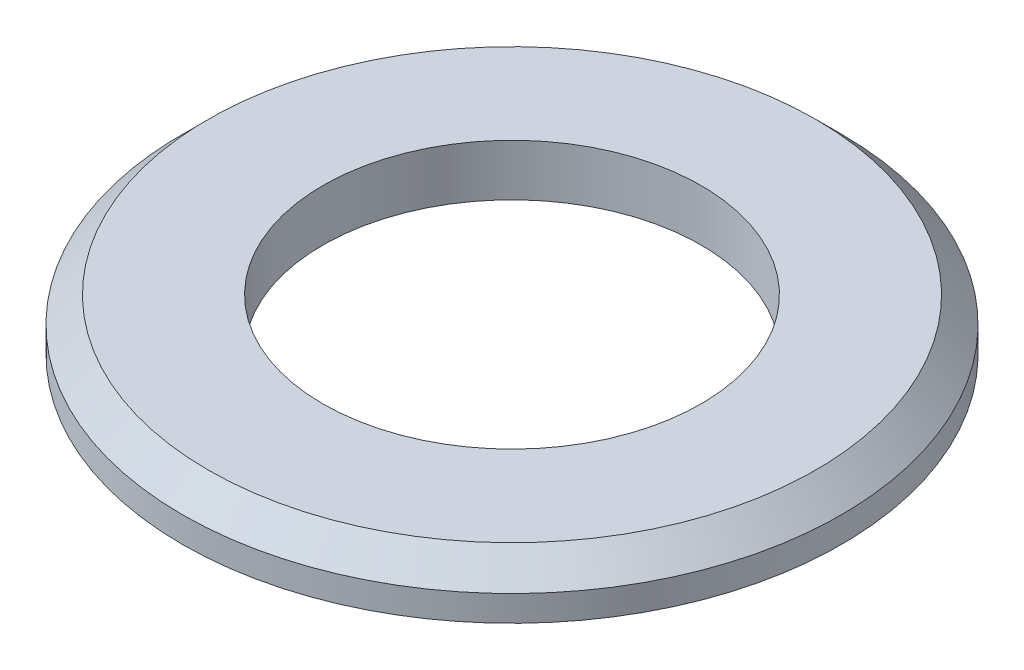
ISO-10303-21;
HEADER;
FILE_DESCRIPTION(('STEP AP214'),'2;1');
FILE_NAME('part.step','',(''),(''),'','','');
FILE_SCHEMA(('AUTOMOTIVE_DESIGN { 1 0 10303 214 1 1 1 1 }'));
ENDSEC;
DATA;
#1=APPLICATION_CONTEXT('core data for automotive mechanical design processes');
#2=APPLICATION_PROTOCOL_DEFINITION('international standard','automotive_design',2000,#1);
#3=PRODUCT_CONTEXT('',#1,'mechanical');
#4=PRODUCT('Part','Part','',(#3));
#5=PRODUCT_RELATED_PRODUCT_CATEGORY('part','',(#4));
#6=PRODUCT_DEFINITION_FORMATION('','',#4);
#7=PRODUCT_DEFINITION_CONTEXT('part definition',#1,'design');
#8=PRODUCT_DEFINITION('design','',#6,#7);
#9=PRODUCT_DEFINITION_SHAPE('','',#8);
#10=(LENGTH_UNIT() NAMED_UNIT(*) SI_UNIT(.MILLI.,.METRE.));
#11=(NAMED_UNIT(*) PLANE_ANGLE_UNIT() SI_UNIT($,.RADIAN.));
#12=(NAMED_UNIT(*) SI_UNIT($,.STERADIAN.) SOLID_ANGLE_UNIT());
#13=UNCERTAINTY_MEASURE_WITH_UNIT(LENGTH_MEASURE(1.E-05),#10,'distance_accuracy_value','');
#14=(GEOMETRIC_REPRESENTATION_CONTEXT(3) GLOBAL_UNCERTAINTY_ASSIGNED_CONTEXT((#13)) GLOBAL_UNIT_ASSIGNED_CONTEXT((#10,
#11,#12)) REPRESENTATION_CONTEXT('',''));
#15=CARTESIAN_POINT('',(0.,0.,0.));
#16=DIRECTION('',(0.,0.,1.));
#17=DIRECTION('',(1.,0.,0.));
#18=AXIS2_PLACEMENT_3D('',#15,#16,#17);
#19=CARTESIAN_POINT('',(0.,9.,0.));
#20=DIRECTION('',(0.,1.,0.));
#21=DIRECTION('',(0.,0.,1.));
#22=AXIS2_PLACEMENT_3D('',#19,#20,#21);
#23=PLANE('',#22);
#24=CARTESIAN_POINT('',(0.,9.,0.));
#25=DIRECTION('',(0.,1.,0.));
#26=DIRECTION('',(0.,0.,1.));
#27=AXIS2_PLACEMENT_3D('',#24,#25,#26);
#28=CIRCLE('',#27,53.);
#29=CARTESIAN_POINT('',(0.,9.,53.));
#30=VERTEX_POINT('',#29);
#31=EDGE_CURVE('E35',#30,#30,#28,.T.);
#32=ORIENTED_EDGE('',*,*,#31,.T.);
#33=EDGE_LOOP('',(#32));
#34=FACE_BOUND('',#33,.T.);
#35=CARTESIAN_POINT('',(0.,9.,0.));
#36=DIRECTION('',(0.,1.,0.));
#37=DIRECTION('',(0.,0.,1.));
#38=AXIS2_PLACEMENT_3D('',#35,#36,#37);
#39=CIRCLE('',#38,33.);
#40=CARTESIAN_POINT('',(0.,9.,33.));
#41=VERTEX_POINT('',#40);
#42=EDGE_CURVE('E43',#41,#41,#39,.T.);
#43=ORIENTED_EDGE('',*,*,#42,.F.);
#44=EDGE_LOOP('',(#43));
#45=FACE_BOUND('',#44,.T.);
#46=ADVANCED_FACE('F28',(#34,#45),#23,.T.);
#47=CARTESIAN_POINT('',(0.,0.,0.));
#48=DIRECTION('',(0.,1.,0.));
#49=DIRECTION('',(0.,0.,1.));
#50=AXIS2_PLACEMENT_3D('',#47,#48,#49);
#51=PLANE('',#50);
#52=CARTESIAN_POINT('',(0.,0.,0.));
#53=DIRECTION('',(0.,1.,0.));
#54=DIRECTION('',(0.,0.,1.));
#55=AXIS2_PLACEMENT_3D('',#52,#53,#54);
#56=CIRCLE('',#55,57.5);
#57=CARTESIAN_POINT('',(0.,0.,57.5));
#58=VERTEX_POINT('',#57);
#59=EDGE_CURVE('E39',#58,#58,#56,.T.);
#60=ORIENTED_EDGE('',*,*,#59,.F.);
#61=EDGE_LOOP('',(#60));
#62=FACE_BOUND('',#61,.T.);
#63=CARTESIAN_POINT('',(0.,0.,0.));
#64=DIRECTION('',(0.,1.,0.));
#65=DIRECTION('',(0.,0.,1.));
#66=AXIS2_PLACEMENT_3D('',#63,#64,#65);
#67=CIRCLE('',#66,33.);
#68=CARTESIAN_POINT('',(0.,0.,33.));
#69=VERTEX_POINT('',#68);
#70=EDGE_CURVE('E48',#69,#69,#67,.T.);
#71=ORIENTED_EDGE('',*,*,#70,.T.);
#72=EDGE_LOOP('',(#71));
#73=FACE_BOUND('',#72,.T.);
#74=ADVANCED_FACE('F52',(#62,#73),#51,.F.);
#75=CARTESIAN_POINT('',(0.,9.,0.));
#76=DIRECTION('',(0.,-1.,0.));
#77=DIRECTION('',(0.,0.,-1.));
#78=AXIS2_PLACEMENT_3D('',#75,#76,#77);
#79=CYLINDRICAL_SURFACE('',#78,57.5);
#80=CARTESIAN_POINT('',(0.,4.50000000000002,0.));
#81=DIRECTION('',(0.,1.,0.));
#82=DIRECTION('',(0.,0.,1.));
#83=AXIS2_PLACEMENT_3D('',#80,#81,#82);
#84=CIRCLE('',#83,57.5);
#85=CARTESIAN_POINT('',(0.,4.50000000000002,57.5));
#86=VERTEX_POINT('',#85);
#87=EDGE_CURVE('E10',#86,#86,#84,.F.);
#88=ORIENTED_EDGE('',*,*,#87,.T.);
#89=EDGE_LOOP('',(#88));
#90=FACE_BOUND('',#89,.T.);
#91=ORIENTED_EDGE('',*,*,#59,.T.);
#92=EDGE_LOOP('',(#91));
#93=FACE_BOUND('',#92,.T.);
#94=ADVANCED_FACE('F30',(#90,#93),#79,.T.);
#95=CARTESIAN_POINT('',(0.,9.,0.));
#96=DIRECTION('',(0.,-1.,0.));
#97=DIRECTION('',(0.,0.,-1.));
#98=AXIS2_PLACEMENT_3D('',#95,#96,#97);
#99=CYLINDRICAL_SURFACE('',#98,33.);
#100=ORIENTED_EDGE('',*,*,#42,.T.);
#101=EDGE_LOOP('',(#100));
#102=FACE_BOUND('',#101,.T.);
#103=ORIENTED_EDGE('',*,*,#70,.F.);
#104=EDGE_LOOP('',(#103));
#105=FACE_BOUND('',#104,.T.);
#106=ADVANCED_FACE('F54',(#102,#105),#99,.F.);
#107=CARTESIAN_POINT('',(0.,9.,0.));
#108=DIRECTION('',(0.,-1.,0.));
#109=DIRECTION('',(0.,0.,-1.));
#110=AXIS2_PLACEMENT_3D('',#107,#108,#109);
#111=CONICAL_SURFACE('',#110,53.,0.785398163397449);
#112=ORIENTED_EDGE('',*,*,#87,.F.);
#113=EDGE_LOOP('',(#112));
#114=FACE_BOUND('',#113,.T.);
#115=ORIENTED_EDGE('',*,*,#31,.F.);
#116=EDGE_LOOP('',(#115));
#117=FACE_BOUND('',#116,.T.);
#118=ADVANCED_FACE('F56',(#114,#117),#111,.T.);
#119=CLOSED_SHELL('',(#46,#74,#94,#106,#118));
#120=MANIFOLD_SOLID_BREP('B2',#119);
#121=ADVANCED_BREP_SHAPE_REPRESENTATION('',(#18,#120),#14);
#122=SHAPE_DEFINITION_REPRESENTATION(#9,#121);
ENDSEC;
END-ISO-10303-21;
